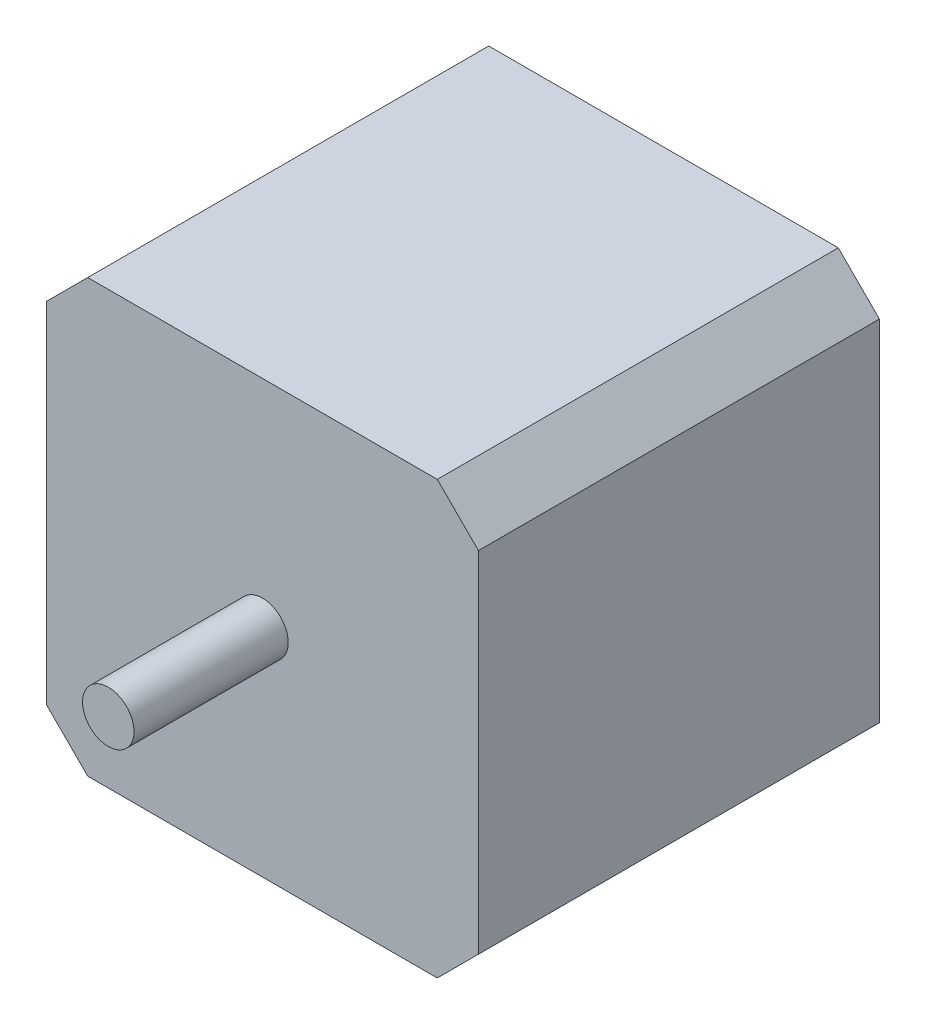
from build123d import *

# Parameters (mm, degrees)
ESQUISSE1_W        = 42
ESQUISSE1_H        = 42
BOSS_EXTRU_1_DEPTH = 39
ESQUISSE3_R        = 2.5
BOSS_EXTRU_2_DEPTH = 15
CHANFREIN1_SIZE    = 4


with BuildPart() as part:
    # Esquisse1 → Boss.-Extru.1 (new body)
    with BuildSketch(Plane.XY):
        with Locations((21, 21)):
            Rectangle(ESQUISSE1_W, ESQUISSE1_H)
    extrude(amount=BOSS_EXTRU_1_DEPTH)

    # Esquisse3 → Boss.-Extru.2 (add)
    with BuildSketch(Plane.XY.offset(39)):
        with Locations(Location((21, 21, 0), (0, 0, 180))):
            Circle(ESQUISSE3_R)
    extrude(amount=BOSS_EXTRU_2_DEPTH)

    # Chanfrein1
    chanfrein1_edges = [part.edges().sort_by_distance(p)[0] for p in [
        (0, 42, 19.5),
        (42, 42, 19.5),
        (42, 0, 19.5),
        (0, 0, 19.5),
    ]]
    chamfer(chanfrein1_edges, length=CHANFREIN1_SIZE)


solid = part.part
